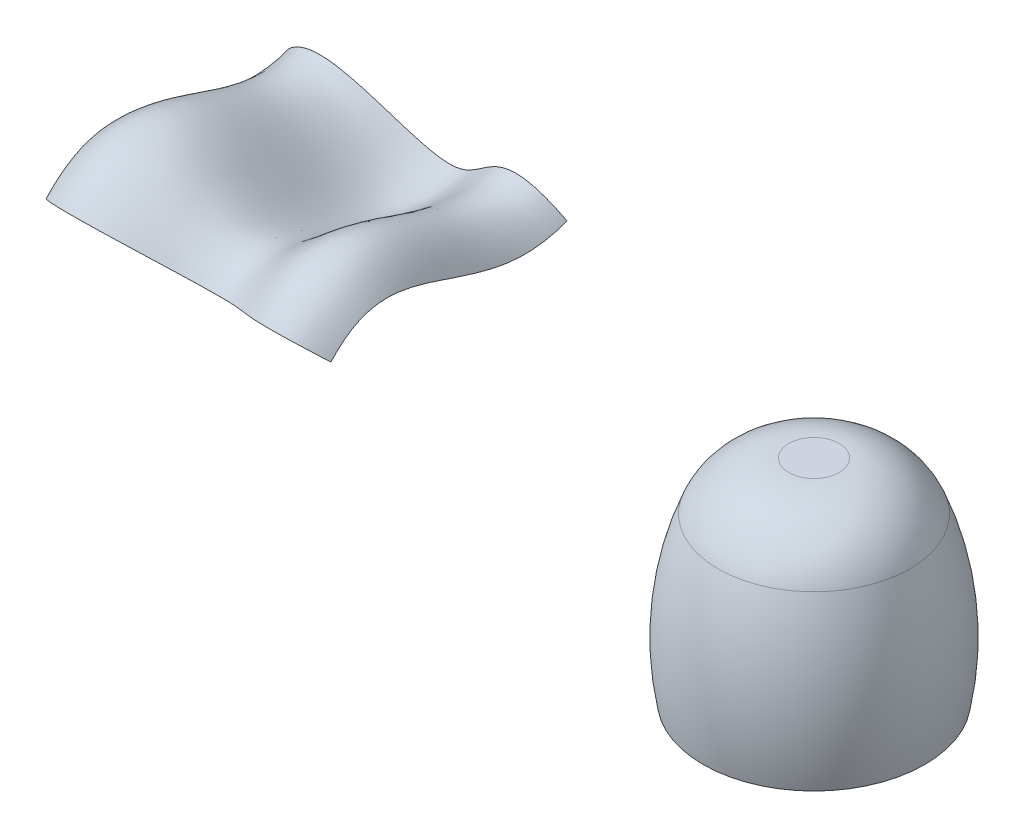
from build123d import *


with BuildPart() as part:
    # Sketch3 → Revolve1 (revolve)
    with BuildSketch(Plane.XY, mode=Mode.PRIVATE) as revolve1_sk:
        with BuildLine():
            Line((385.524009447, 64.962712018), (385.524009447, -98.511800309))
            Line((385.524009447, -98.511800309), (471.780203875, -98.511800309))
            ThreePointArc((471.780203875, -98.511800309), (474.875904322, -34.682916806), (460.096128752, 27.488362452))
            ThreePointArc((460.096128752, 27.488362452), (438.382180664, 54.703243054), (405.112245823, 64.962712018))
            Line((405.112245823, 64.962712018), (385.524009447, 64.962712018))
        make_face()
    revolve(revolve1_sk.sketch.rotate(Axis((385.524009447, 64.962712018, 0), (0, -1, 0)), 180), axis=Axis((385.524009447, 64.962712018, 0), (0, -1, 0)))


solid = part.part
